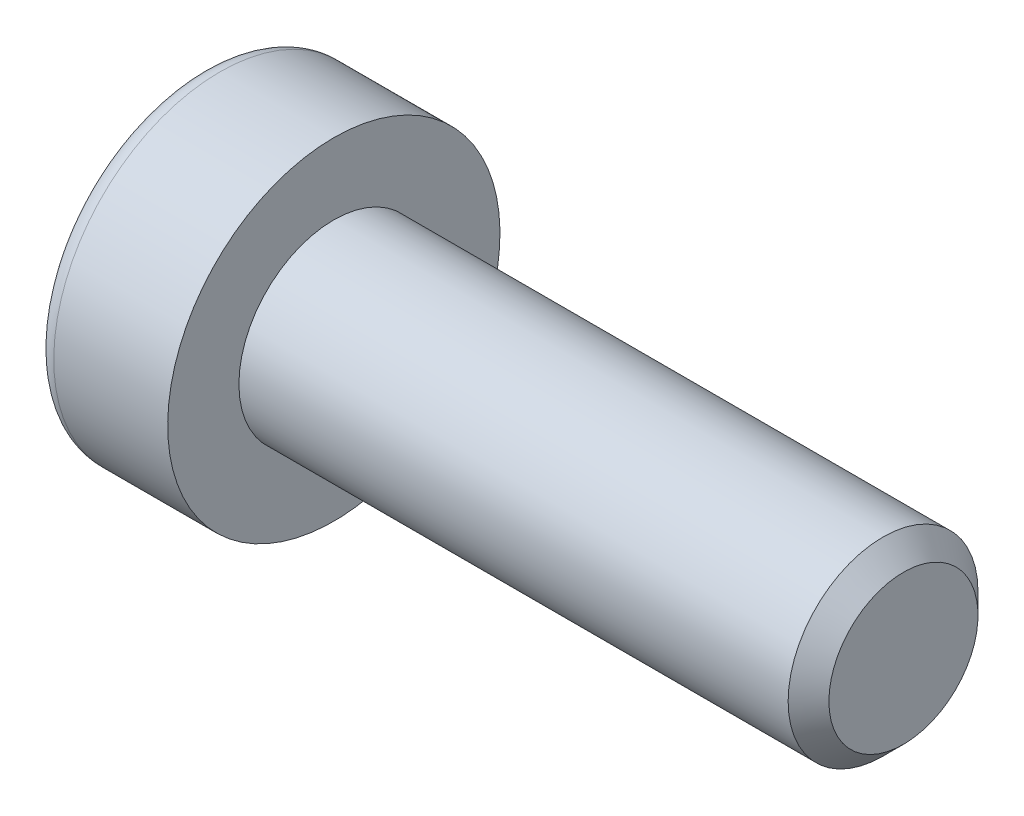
ISO-10303-21;
HEADER;
FILE_DESCRIPTION(('STEP AP214'),'2;1');
FILE_NAME('part.step','',(''),(''),'','','');
FILE_SCHEMA(('AUTOMOTIVE_DESIGN { 1 0 10303 214 1 1 1 1 }'));
ENDSEC;
DATA;
#1=APPLICATION_CONTEXT('core data for automotive mechanical design processes');
#2=APPLICATION_PROTOCOL_DEFINITION('international standard','automotive_design',2000,#1);
#3=PRODUCT_CONTEXT('',#1,'mechanical');
#4=PRODUCT('Part','Part','',(#3));
#5=PRODUCT_RELATED_PRODUCT_CATEGORY('part','',(#4));
#6=PRODUCT_DEFINITION_FORMATION('','',#4);
#7=PRODUCT_DEFINITION_CONTEXT('part definition',#1,'design');
#8=PRODUCT_DEFINITION('design','',#6,#7);
#9=PRODUCT_DEFINITION_SHAPE('','',#8);
#10=(LENGTH_UNIT() NAMED_UNIT(*) SI_UNIT(.MILLI.,.METRE.));
#11=(NAMED_UNIT(*) PLANE_ANGLE_UNIT() SI_UNIT($,.RADIAN.));
#12=(NAMED_UNIT(*) SI_UNIT($,.STERADIAN.) SOLID_ANGLE_UNIT());
#13=UNCERTAINTY_MEASURE_WITH_UNIT(LENGTH_MEASURE(1.E-05),#10,'distance_accuracy_value','');
#14=(GEOMETRIC_REPRESENTATION_CONTEXT(3) GLOBAL_UNCERTAINTY_ASSIGNED_CONTEXT((#13)) GLOBAL_UNIT_ASSIGNED_CONTEXT((#10,
#11,#12)) REPRESENTATION_CONTEXT('',''));
#15=CARTESIAN_POINT('',(0.,0.,0.));
#16=DIRECTION('',(0.,0.,1.));
#17=DIRECTION('',(1.,0.,0.));
#18=AXIS2_PLACEMENT_3D('',#15,#16,#17);
#19=CARTESIAN_POINT('',(-2.8,-1.25,0.721687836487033));
#20=DIRECTION('',(0.,-0.5,0.866025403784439));
#21=DIRECTION('',(0.,-0.866025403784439,-0.5));
#22=AXIS2_PLACEMENT_3D('',#19,#20,#21);
#23=PLANE('',#22);
#24=DIRECTION('',(1.,0.,0.));
#25=VECTOR('',#24,1.);
#26=CARTESIAN_POINT('',(-2.8,-1.25,0.721687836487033));
#27=LINE('',#26,#25);
#28=CARTESIAN_POINT('',(-0.500000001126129,-1.24999999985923,0.721687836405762));
#29=VERTEX_POINT('',#28);
#30=CARTESIAN_POINT('',(-2.8,-1.25,0.721687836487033));
#31=VERTEX_POINT('',#30);
#32=EDGE_CURVE('E76',#29,#31,#27,.F.);
#33=ORIENTED_EDGE('',*,*,#32,.T.);
#34=DIRECTION('',(0.,-0.866025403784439,-0.5));
#35=VECTOR('',#34,1.);
#36=CARTESIAN_POINT('',(-2.8,-1.25,0.721687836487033));
#37=LINE('',#36,#35);
#38=CARTESIAN_POINT('',(-2.8,0.,1.44337567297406));
#39=VERTEX_POINT('',#38);
#40=EDGE_CURVE('E82',#39,#31,#37,.T.);
#41=ORIENTED_EDGE('',*,*,#40,.F.);
#42=DIRECTION('',(1.,0.,0.));
#43=VECTOR('',#42,1.);
#44=CARTESIAN_POINT('',(-2.8,0.,1.44337567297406));
#45=LINE('',#44,#43);
#46=CARTESIAN_POINT('',(-0.500000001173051,-1.40766858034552E-10,1.44337567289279));
#47=VERTEX_POINT('',#46);
#48=EDGE_CURVE('E79',#39,#47,#45,.T.);
#49=ORIENTED_EDGE('',*,*,#48,.T.);
#50=CARTESIAN_POINT('',(-0.500000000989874,-1.24999999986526,0.721687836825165));
#51=CARTESIAN_POINT('',(-0.481684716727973,-1.19507007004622,0.753401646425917));
#52=CARTESIAN_POINT('',(-0.465027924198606,-1.13966598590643,0.78538920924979));
#53=CARTESIAN_POINT('',(-0.435953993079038,-1.02789853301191,0.849918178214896));
#54=CARTESIAN_POINT('',(-0.423547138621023,-0.971533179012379,0.882460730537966));
#55=CARTESIAN_POINT('',(-0.404234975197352,-0.859500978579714,0.947142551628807));
#56=CARTESIAN_POINT('',(-0.397201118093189,-0.803851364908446,0.979271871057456));
#57=CARTESIAN_POINT('',(-0.388805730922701,-0.692290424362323,1.04368161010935));
#58=CARTESIAN_POINT('',(-0.387437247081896,-0.636379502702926,1.07596179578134));
#59=CARTESIAN_POINT('',(-0.390291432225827,-0.531915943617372,1.1362738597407));
#60=CARTESIAN_POINT('',(-0.393813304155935,-0.483347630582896,1.16431478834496));
#61=CARTESIAN_POINT('',(-0.404973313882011,-0.386527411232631,1.22021396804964));
#62=CARTESIAN_POINT('',(-0.412615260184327,-0.338275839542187,1.24807202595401));
#63=CARTESIAN_POINT('',(-0.431718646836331,-0.241256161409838,1.30408636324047));
#64=CARTESIAN_POINT('',(-0.443261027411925,-0.192500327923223,1.33223555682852));
#65=CARTESIAN_POINT('',(-0.469457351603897,-0.0957156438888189,1.38811422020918));
#66=CARTESIAN_POINT('',(-0.484105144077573,-0.0476855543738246,1.41584440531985));
#67=CARTESIAN_POINT('',(-0.500000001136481,-2.50478505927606E-10,1.44337567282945));
#68=B_SPLINE_CURVE_WITH_KNOTS('',3,(#50,#51,#52,#53,#54,#55,#56,#57,#58,#59,#60,#61,#62,#63,#64,
#65,#66,#67),.UNSPECIFIED.,.F.,.F.,(4,2,2,2,2,2,2,2,4),(0.,0.198135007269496,0.396746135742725,
0.590442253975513,0.783900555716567,0.952317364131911,1.12089012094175,1.29320101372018,
1.46517373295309),.UNSPECIFIED.);
#69=EDGE_CURVE('E19',#29,#47,#68,.T.);
#70=ORIENTED_EDGE('',*,*,#69,.F.);
#71=EDGE_LOOP('',(#33,#41,#49,#70));
#72=FACE_BOUND('',#71,.T.);
#73=ADVANCED_FACE('F15',(#72),#23,.F.);
#74=CARTESIAN_POINT('',(-2.8,-1.25,-0.721687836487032));
#75=DIRECTION('',(0.,-1.,0.));
#76=DIRECTION('',(0.,0.,-1.));
#77=AXIS2_PLACEMENT_3D('',#74,#75,#76);
#78=PLANE('',#77);
#79=DIRECTION('',(1.,0.,0.));
#80=VECTOR('',#79,1.);
#81=CARTESIAN_POINT('',(-2.8,-1.25,-0.721687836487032));
#82=LINE('',#81,#80);
#83=CARTESIAN_POINT('',(-0.500000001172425,-1.25,-0.721687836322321));
#84=VERTEX_POINT('',#83);
#85=CARTESIAN_POINT('',(-2.8,-1.25,-0.721687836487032));
#86=VERTEX_POINT('',#85);
#87=EDGE_CURVE('E150',#84,#86,#82,.F.);
#88=ORIENTED_EDGE('',*,*,#87,.T.);
#89=DIRECTION('',(0.,0.,-1.));
#90=VECTOR('',#89,1.);
#91=CARTESIAN_POINT('',(-2.8,-1.25,-0.721687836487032));
#92=LINE('',#91,#90);
#93=EDGE_CURVE('E93',#31,#86,#92,.T.);
#94=ORIENTED_EDGE('',*,*,#93,.F.);
#95=ORIENTED_EDGE('',*,*,#32,.F.);
#96=CARTESIAN_POINT('',(-0.500000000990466,-1.25000000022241,-0.721687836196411));
#97=CARTESIAN_POINT('',(-0.481684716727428,-1.25000000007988,-0.658260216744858));
#98=CARTESIAN_POINT('',(-0.465027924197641,-1.25000000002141,-0.594285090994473));
#99=CARTESIAN_POINT('',(-0.435953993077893,-1.24999999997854,-0.465227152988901));
#100=CARTESIAN_POINT('',(-0.423547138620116,-1.24999999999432,-0.400142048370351));
#101=CARTESIAN_POINT('',(-0.404234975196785,-1.25000000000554,-0.27077840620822));
#102=CARTESIAN_POINT('',(-0.397201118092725,-1.25000000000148,-0.206519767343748));
#103=CARTESIAN_POINT('',(-0.388805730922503,-1.24999999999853,-0.0777002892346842));
#104=CARTESIAN_POINT('',(-0.387437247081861,-1.24999999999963,-0.0131399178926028));
#105=CARTESIAN_POINT('',(-0.390291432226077,-1.25000000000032,0.107484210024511));
#106=CARTESIAN_POINT('',(-0.393813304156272,-1.25000000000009,0.163566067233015));
#107=CARTESIAN_POINT('',(-0.404973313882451,-1.24999999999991,0.27536442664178));
#108=CARTESIAN_POINT('',(-0.412615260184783,-1.24999999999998,0.331080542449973));
#109=CARTESIAN_POINT('',(-0.431718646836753,-1.25000000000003,0.443109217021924));
#110=CARTESIAN_POINT('',(-0.443261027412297,-1.25000000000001,0.499407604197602));
#111=CARTESIAN_POINT('',(-0.469457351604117,-1.24999999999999,0.611164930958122));
#112=CARTESIAN_POINT('',(-0.484105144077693,-1.24999999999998,0.666625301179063));
#113=CARTESIAN_POINT('',(-0.500000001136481,-1.25,0.721687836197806));
#114=B_SPLINE_CURVE_WITH_KNOTS('',3,(#96,#97,#98,#99,#100,#101,#102,#103,#104,#105,#106,#107,
#108,#109,#110,#111,#112,#113),.UNSPECIFIED.,.F.,.F.,(4,2,2,2,2,2,2,2,4),(0.,0.198135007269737,
0.39674613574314,0.590442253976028,0.783900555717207,0.952317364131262,1.12089012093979,
1.2932010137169,1.46517373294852),.UNSPECIFIED.);
#115=EDGE_CURVE('E84',#84,#29,#114,.T.);
#116=ORIENTED_EDGE('',*,*,#115,.F.);
#117=EDGE_LOOP('',(#88,#94,#95,#116));
#118=FACE_BOUND('',#117,.T.);
#119=ADVANCED_FACE('F94',(#118),#78,.F.);
#120=CARTESIAN_POINT('',(-2.8,0.,1.44337567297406));
#121=DIRECTION('',(0.,0.500000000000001,0.866025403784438));
#122=DIRECTION('',(0.,-0.866025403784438,0.500000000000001));
#123=AXIS2_PLACEMENT_3D('',#120,#121,#122);
#124=PLANE('',#123);
#125=ORIENTED_EDGE('',*,*,#48,.F.);
#126=DIRECTION('',(0.,-0.866025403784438,0.500000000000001));
#127=VECTOR('',#126,1.);
#128=CARTESIAN_POINT('',(-2.8,0.,1.44337567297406));
#129=LINE('',#128,#127);
#130=CARTESIAN_POINT('',(-2.8,1.25,0.721687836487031));
#131=VERTEX_POINT('',#130);
#132=EDGE_CURVE('E92',#131,#39,#129,.T.);
#133=ORIENTED_EDGE('',*,*,#132,.F.);
#134=DIRECTION('',(1.,0.,0.));
#135=VECTOR('',#134,1.);
#136=CARTESIAN_POINT('',(-2.8,1.25,0.721687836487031));
#137=LINE('',#136,#135);
#138=CARTESIAN_POINT('',(-0.500000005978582,1.25000001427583,0.721687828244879));
#139=VERTEX_POINT('',#138);
#140=EDGE_CURVE('E225',#131,#139,#137,.T.);
#141=ORIENTED_EDGE('',*,*,#140,.T.);
#142=CARTESIAN_POINT('',(-0.500000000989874,3.60199319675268E-10,1.44337567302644));
#143=CARTESIAN_POINT('',(-0.481684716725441,0.0549299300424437,1.411661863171));
#144=CARTESIAN_POINT('',(-0.465027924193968,0.110334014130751,1.37967430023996));
#145=CARTESIAN_POINT('',(-0.435953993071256,0.222101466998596,1.31514533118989));
#146=CARTESIAN_POINT('',(-0.423547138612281,0.278466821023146,1.28260277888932));
#147=CARTESIAN_POINT('',(-0.404234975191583,0.390499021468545,1.2179209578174));
#148=CARTESIAN_POINT('',(-0.397201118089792,0.446148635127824,1.18579163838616));
#149=CARTESIAN_POINT('',(-0.388805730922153,0.557709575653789,1.12138189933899));
#150=CARTESIAN_POINT('',(-0.387437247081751,0.613620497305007,1.08910171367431));
#151=CARTESIAN_POINT('',(-0.390291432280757,0.718084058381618,1.02878964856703));
#152=CARTESIAN_POINT('',(-0.393813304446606,0.766652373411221,1.00074871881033));
#153=CARTESIAN_POINT('',(-0.404973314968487,0.863472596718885,0.944849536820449));
#154=CARTESIAN_POINT('',(-0.412615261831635,0.911724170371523,0.916991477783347));
#155=CARTESIAN_POINT('',(-0.431718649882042,1.0087438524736,0.860977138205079));
#156=CARTESIAN_POINT('',(-0.443261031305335,1.05749968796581,0.832827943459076));
#157=CARTESIAN_POINT('',(-0.469457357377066,1.15428437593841,0.776949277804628));
#158=CARTESIAN_POINT('',(-0.484105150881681,1.20231446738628,0.749219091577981));
#159=CARTESIAN_POINT('',(-0.50000000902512,1.25000002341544,0.721687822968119));
#160=B_SPLINE_CURVE_WITH_KNOTS('',3,(#142,#143,#144,#145,#146,#147,#148,#149,#150,#151,#152,
#153,#154,#155,#156,#157,#158,#159),.UNSPECIFIED.,.F.,.F.,(4,2,2,2,2,2,2,2,4),(0.,
0.198135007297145,0.396746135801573,0.590442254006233,0.78390055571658,0.952317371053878,
1.12089013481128,1.29320103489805,1.46517376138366),.UNSPECIFIED.);
#161=EDGE_CURVE('E145',#47,#139,#160,.T.);
#162=ORIENTED_EDGE('',*,*,#161,.F.);
#163=EDGE_LOOP('',(#125,#133,#141,#162));
#164=FACE_BOUND('',#163,.T.);
#165=ADVANCED_FACE('F151',(#164),#124,.F.);
#166=CARTESIAN_POINT('',(-2.8,0.,-1.44337567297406));
#167=DIRECTION('',(0.,-0.5,-0.866025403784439));
#168=DIRECTION('',(0.,0.866025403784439,-0.5));
#169=AXIS2_PLACEMENT_3D('',#166,#167,#168);
#170=PLANE('',#169);
#171=DIRECTION('',(1.,0.,0.));
#172=VECTOR('',#171,1.);
#173=CARTESIAN_POINT('',(-2.8,0.,-1.44337567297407));
#174=LINE('',#173,#172);
#175=CARTESIAN_POINT('',(-0.499999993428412,-5.19432852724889E-08,-1.44337565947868));
#176=VERTEX_POINT('',#175);
#177=CARTESIAN_POINT('',(-2.8,0.,-1.44337567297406));
#178=VERTEX_POINT('',#177);
#179=EDGE_CURVE('E223',#176,#178,#174,.F.);
#180=ORIENTED_EDGE('',*,*,#179,.T.);
#181=DIRECTION('',(0.,0.866025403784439,-0.5));
#182=VECTOR('',#181,1.);
#183=CARTESIAN_POINT('',(-2.8,0.,-1.44337567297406));
#184=LINE('',#183,#182);
#185=EDGE_CURVE('E38',#86,#178,#184,.T.);
#186=ORIENTED_EDGE('',*,*,#185,.F.);
#187=ORIENTED_EDGE('',*,*,#87,.F.);
#188=CARTESIAN_POINT('',(-0.500000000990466,-1.24999999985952,-0.721687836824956));
#189=CARTESIAN_POINT('',(-0.481684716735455,-1.19507007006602,-0.75340164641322));
#190=CARTESIAN_POINT('',(-0.465027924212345,-1.13966598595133,-0.785389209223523));
#191=CARTESIAN_POINT('',(-0.435953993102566,-1.02789853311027,-0.849918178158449));
#192=CARTESIAN_POINT('',(-0.423547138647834,-0.971533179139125,-0.882460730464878));
#193=CARTESIAN_POINT('',(-0.404234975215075,-0.859500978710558,-0.947142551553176));
#194=CARTESIAN_POINT('',(-0.397201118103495,-0.803851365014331,-0.979271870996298));
#195=CARTESIAN_POINT('',(-0.388805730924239,-0.692290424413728,-1.0436816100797));
#196=CARTESIAN_POINT('',(-0.387437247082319,-0.636379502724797,-1.07596179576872));
#197=CARTESIAN_POINT('',(-0.390291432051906,-0.531915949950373,-1.13627385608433));
#198=CARTESIAN_POINT('',(-0.393813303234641,-0.48334764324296,-1.16431478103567));
#199=CARTESIAN_POINT('',(-0.404973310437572,-0.386527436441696,-1.22021395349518));
#200=CARTESIAN_POINT('',(-0.412615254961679,-0.33827587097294,-1.24807200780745));
#201=CARTESIAN_POINT('',(-0.431718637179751,-0.241256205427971,-1.30408633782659));
#202=CARTESIAN_POINT('',(-0.443261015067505,-0.192500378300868,-1.33223552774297));
#203=CARTESIAN_POINT('',(-0.469457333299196,-0.0957157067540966,-1.3881141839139));
#204=CARTESIAN_POINT('',(-0.48410512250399,-0.0476856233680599,-1.41584436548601));
#205=CARTESIAN_POINT('',(-0.499999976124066,-7.52877252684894E-08,-1.44337562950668));
#206=B_SPLINE_CURVE_WITH_KNOTS('',3,(#188,#189,#190,#191,#192,#193,#194,#195,#196,#197,#198,
#199,#200,#201,#202,#203,#204,#205),.UNSPECIFIED.,.F.,.F.,(4,2,2,2,2,2,2,2,4),(0.,
0.198135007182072,0.396746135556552,0.590442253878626,0.783900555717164,0.952317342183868,
1.12089007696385,1.29320094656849,1.46517364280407),.UNSPECIFIED.);
#207=EDGE_CURVE('E88',#84,#176,#206,.T.);
#208=ORIENTED_EDGE('',*,*,#207,.T.);
#209=EDGE_LOOP('',(#180,#186,#187,#208));
#210=FACE_BOUND('',#209,.T.);
#211=ADVANCED_FACE('F154',(#210),#170,.F.);
#212=CARTESIAN_POINT('',(-2.8,1.25,0.721687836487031));
#213=DIRECTION('',(0.,1.,0.));
#214=DIRECTION('',(0.,0.,1.));
#215=AXIS2_PLACEMENT_3D('',#212,#213,#214);
#216=PLANE('',#215);
#217=ORIENTED_EDGE('',*,*,#140,.F.);
#218=DIRECTION('',(0.,0.,1.));
#219=VECTOR('',#218,1.);
#220=CARTESIAN_POINT('',(-2.8,1.25,0.721687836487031));
#221=LINE('',#220,#219);
#222=CARTESIAN_POINT('',(-2.8,1.25,-0.721687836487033));
#223=VERTEX_POINT('',#222);
#224=EDGE_CURVE('E228',#223,#131,#221,.T.);
#225=ORIENTED_EDGE('',*,*,#224,.F.);
#226=DIRECTION('',(1.,0.,0.));
#227=VECTOR('',#226,1.);
#228=CARTESIAN_POINT('',(-2.8,1.25,-0.721687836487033));
#229=LINE('',#228,#227);
#230=CARTESIAN_POINT('',(-0.500000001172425,1.25,-0.721687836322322));
#231=VERTEX_POINT('',#230);
#232=EDGE_CURVE('E117',#223,#231,#229,.T.);
#233=ORIENTED_EDGE('',*,*,#232,.T.);
#234=CARTESIAN_POINT('',(-0.500000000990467,1.25000000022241,-0.721687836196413));
#235=CARTESIAN_POINT('',(-0.481684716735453,1.25000000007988,-0.658260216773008));
#236=CARTESIAN_POINT('',(-0.465027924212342,1.25000000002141,-0.594285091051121));
#237=CARTESIAN_POINT('',(-0.435953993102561,1.24999999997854,-0.465227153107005));
#238=CARTESIAN_POINT('',(-0.423547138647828,1.24999999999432,-0.400142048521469));
#239=CARTESIAN_POINT('',(-0.404234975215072,1.25000000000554,-0.27077840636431));
#240=CARTESIAN_POINT('',(-0.397201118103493,1.25000000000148,-0.206519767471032));
#241=CARTESIAN_POINT('',(-0.388805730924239,1.24999999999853,-0.0777002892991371));
#242=CARTESIAN_POINT('',(-0.387437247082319,1.24999999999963,-0.0131399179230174));
#243=CARTESIAN_POINT('',(-0.390291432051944,1.25000000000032,0.107484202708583));
#244=CARTESIAN_POINT('',(-0.393813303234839,1.25000000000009,0.163566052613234));
#245=CARTESIAN_POINT('',(-0.404973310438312,1.24999999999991,0.275364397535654));
#246=CARTESIAN_POINT('',(-0.412615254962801,1.24999999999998,0.331080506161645));
#247=CARTESIAN_POINT('',(-0.431718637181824,1.25000000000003,0.443109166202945));
#248=CARTESIAN_POINT('',(-0.443261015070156,1.25000000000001,0.499407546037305));
#249=CARTESIAN_POINT('',(-0.469457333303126,1.24999999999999,0.6111648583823));
#250=CARTESIAN_POINT('',(-0.484105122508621,1.24999999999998,0.666625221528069));
#251=CARTESIAN_POINT('',(-0.499999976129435,1.25,0.721687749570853));
#252=B_SPLINE_CURVE_WITH_KNOTS('',3,(#234,#235,#236,#237,#238,#239,#240,#241,#242,#243,#244,
#245,#246,#247,#248,#249,#250,#251),.UNSPECIFIED.,.F.,.F.,(4,2,2,2,2,2,2,2,4),(0.,
0.198135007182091,0.396746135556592,0.590442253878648,0.783900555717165,0.95231734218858,
1.12089007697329,1.2932009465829,1.46517364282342),.UNSPECIFIED.);
#253=EDGE_CURVE('E118',#231,#139,#252,.T.);
#254=ORIENTED_EDGE('',*,*,#253,.T.);
#255=EDGE_LOOP('',(#217,#225,#233,#254));
#256=FACE_BOUND('',#255,.T.);
#257=ADVANCED_FACE('F129',(#256),#216,.F.);
#258=CARTESIAN_POINT('',(-0.505000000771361,0.,0.));
#259=DIRECTION('',(-1.,0.,0.));
#260=DIRECTION('',(0.,0.,1.));
#261=AXIS2_PLACEMENT_3D('',#258,#259,#260);
#262=CONICAL_SURFACE('',#261,1.45203592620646,1.04719754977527);
#263=CARTESIAN_POINT('',(0.333333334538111,-1.70530256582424E-10,0.));
#264=VERTEX_POINT('',#263);
#265=VERTEX_LOOP('',#264);
#266=FACE_BOUND('',#265,.T.);
#267=ORIENTED_EDGE('',*,*,#253,.F.);
#268=CARTESIAN_POINT('',(-0.500000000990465,1.24999999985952,-0.721687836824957));
#269=CARTESIAN_POINT('',(-0.481684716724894,1.19507007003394,-0.753401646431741));
#270=CARTESIAN_POINT('',(-0.465027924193,1.13966598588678,-0.785389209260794));
#271=CARTESIAN_POINT('',(-0.435953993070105,1.02789853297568,-0.849918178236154));
#272=CARTESIAN_POINT('',(-0.423547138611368,0.971533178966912,-0.882460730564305));
#273=CARTESIAN_POINT('',(-0.404234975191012,0.859500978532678,-0.947142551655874));
#274=CARTESIAN_POINT('',(-0.397201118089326,0.803851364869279,-0.979271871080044));
#275=CARTESIAN_POINT('',(-0.388805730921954,0.692290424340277,-1.0436816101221));
#276=CARTESIAN_POINT('',(-0.387437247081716,0.636379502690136,-1.07596179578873));
#277=CARTESIAN_POINT('',(-0.390291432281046,0.531915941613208,-1.1362738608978));
#278=CARTESIAN_POINT('',(-0.393813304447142,0.483347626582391,-1.16431479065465));
#279=CARTESIAN_POINT('',(-0.404973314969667,0.386527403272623,-1.22021397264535));
#280=CARTESIAN_POINT('',(-0.412615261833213,0.338275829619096,-1.24807203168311));
#281=CARTESIAN_POINT('',(-0.431718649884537,0.241256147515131,-1.30408637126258));
#282=CARTESIAN_POINT('',(-0.443261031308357,0.19250031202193,-1.33223556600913));
#283=CARTESIAN_POINT('',(-0.469457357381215,0.0957156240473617,-1.38811423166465));
#284=CARTESIAN_POINT('',(-0.484105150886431,0.0476855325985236,-1.41584441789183));
#285=CARTESIAN_POINT('',(-0.50000000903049,-2.34315494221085E-08,-1.44337568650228));
#286=B_SPLINE_CURVE_WITH_KNOTS('',3,(#268,#269,#270,#271,#272,#273,#274,#275,#276,#277,#278,
#279,#280,#281,#282,#283,#284,#285),.UNSPECIFIED.,.F.,.F.,(4,2,2,2,2,2,2,2,4),(0.,
0.198135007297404,0.396746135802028,0.590442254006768,0.78390055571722,0.952317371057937,
1.12089013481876,1.29320103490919,1.46517376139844),.UNSPECIFIED.);
#287=EDGE_CURVE('E110',#231,#176,#286,.T.);
#288=ORIENTED_EDGE('',*,*,#287,.T.);
#289=ORIENTED_EDGE('',*,*,#207,.F.);
#290=ORIENTED_EDGE('',*,*,#115,.T.);
#291=ORIENTED_EDGE('',*,*,#69,.T.);
#292=ORIENTED_EDGE('',*,*,#161,.T.);
#293=EDGE_LOOP('',(#267,#288,#289,#290,#291,#292));
#294=FACE_BOUND('',#293,.T.);
#295=ADVANCED_FACE('F86',(#266,#294),#262,.F.);
#296=CARTESIAN_POINT('',(-2.8,1.25,-0.721687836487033));
#297=DIRECTION('',(0.,0.5,-0.866025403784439));
#298=DIRECTION('',(0.,0.866025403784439,0.5));
#299=AXIS2_PLACEMENT_3D('',#296,#297,#298);
#300=PLANE('',#299);
#301=ORIENTED_EDGE('',*,*,#232,.F.);
#302=DIRECTION('',(0.,0.866025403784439,0.5));
#303=VECTOR('',#302,1.);
#304=CARTESIAN_POINT('',(-2.8,0.,-1.44337567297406));
#305=LINE('',#304,#303);
#306=EDGE_CURVE('E116',#178,#223,#305,.T.);
#307=ORIENTED_EDGE('',*,*,#306,.F.);
#308=ORIENTED_EDGE('',*,*,#179,.F.);
#309=ORIENTED_EDGE('',*,*,#287,.F.);
#310=EDGE_LOOP('',(#301,#307,#308,#309));
#311=FACE_BOUND('',#310,.T.);
#312=ADVANCED_FACE('F124',(#311),#300,.F.);
#313=CARTESIAN_POINT('',(-2.8,2.47168783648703,0.));
#314=DIRECTION('',(-1.,0.,0.));
#315=DIRECTION('',(0.,0.,1.));
#316=AXIS2_PLACEMENT_3D('',#313,#314,#315);
#317=PLANE('',#316);
#318=ORIENTED_EDGE('',*,*,#185,.T.);
#319=ORIENTED_EDGE('',*,*,#306,.T.);
#320=ORIENTED_EDGE('',*,*,#224,.T.);
#321=ORIENTED_EDGE('',*,*,#132,.T.);
#322=ORIENTED_EDGE('',*,*,#40,.T.);
#323=ORIENTED_EDGE('',*,*,#93,.T.);
#324=EDGE_LOOP('',(#318,#319,#320,#321,#322,#323));
#325=FACE_BOUND('',#324,.T.);
#326=CARTESIAN_POINT('',(-2.8,0.,0.));
#327=DIRECTION('',(1.,0.,0.));
#328=DIRECTION('',(0.,1.,0.));
#329=AXIS2_PLACEMENT_3D('',#326,#327,#328);
#330=CIRCLE('',#329,3.1);
#331=CARTESIAN_POINT('',(-2.8,3.1,0.));
#332=VERTEX_POINT('',#331);
#333=EDGE_CURVE('E204',#332,#332,#330,.T.);
#334=ORIENTED_EDGE('',*,*,#333,.F.);
#335=EDGE_LOOP('',(#334));
#336=FACE_BOUND('',#335,.T.);
#337=ADVANCED_FACE('F191',(#325,#336),#317,.T.);
#338=CARTESIAN_POINT('',(-2.4,0.,0.));
#339=DIRECTION('',(1.,0.,0.));
#340=DIRECTION('',(0.,0.,-1.));
#341=AXIS2_PLACEMENT_3D('',#338,#339,#340);
#342=TOROIDAL_SURFACE('',#341,3.1,0.4);
#343=CARTESIAN_POINT('',(-2.4,0.,0.));
#344=DIRECTION('',(1.,0.,0.));
#345=DIRECTION('',(0.,1.,0.));
#346=AXIS2_PLACEMENT_3D('',#343,#344,#345);
#347=CIRCLE('',#346,3.5);
#348=CARTESIAN_POINT('',(-2.4,3.5,0.));
#349=VERTEX_POINT('',#348);
#350=EDGE_CURVE('E109',#349,#349,#347,.T.);
#351=ORIENTED_EDGE('',*,*,#350,.F.);
#352=EDGE_LOOP('',(#351));
#353=FACE_BOUND('',#352,.T.);
#354=ORIENTED_EDGE('',*,*,#333,.T.);
#355=EDGE_LOOP('',(#354));
#356=FACE_BOUND('',#355,.T.);
#357=ADVANCED_FACE('F186',(#353,#356),#342,.T.);
#358=CARTESIAN_POINT('',(-1.4,0.,0.));
#359=DIRECTION('',(1.,0.,0.));
#360=DIRECTION('',(0.,1.,0.));
#361=AXIS2_PLACEMENT_3D('',#358,#359,#360);
#362=CYLINDRICAL_SURFACE('',#361,3.5);
#363=ORIENTED_EDGE('',*,*,#350,.T.);
#364=EDGE_LOOP('',(#363));
#365=FACE_BOUND('',#364,.T.);
#366=CARTESIAN_POINT('',(0.,0.,0.));
#367=DIRECTION('',(1.,0.,0.));
#368=DIRECTION('',(0.,1.,0.));
#369=AXIS2_PLACEMENT_3D('',#366,#367,#368);
#370=CIRCLE('',#369,3.5);
#371=CARTESIAN_POINT('',(0.,3.5,0.));
#372=VERTEX_POINT('',#371);
#373=EDGE_CURVE('E106',#372,#372,#370,.T.);
#374=ORIENTED_EDGE('',*,*,#373,.F.);
#375=EDGE_LOOP('',(#374));
#376=FACE_BOUND('',#375,.T.);
#377=ADVANCED_FACE('F182',(#365,#376),#362,.T.);
#378=CARTESIAN_POINT('',(12.,1.,0.));
#379=DIRECTION('',(1.,0.,0.));
#380=DIRECTION('',(0.,0.,-1.));
#381=AXIS2_PLACEMENT_3D('',#378,#379,#380);
#382=PLANE('',#381);
#383=CARTESIAN_POINT('',(12.0000000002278,0.,0.));
#384=DIRECTION('',(-1.,0.,0.));
#385=DIRECTION('',(0.,0.,1.));
#386=AXIS2_PLACEMENT_3D('',#383,#384,#385);
#387=CIRCLE('',#386,1.57058500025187);
#388=CARTESIAN_POINT('',(12.0000000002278,0.,1.57058500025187));
#389=VERTEX_POINT('',#388);
#390=EDGE_CURVE('E103',#389,#389,#387,.T.);
#391=ORIENTED_EDGE('',*,*,#390,.F.);
#392=EDGE_LOOP('',(#391));
#393=FACE_BOUND('',#392,.T.);
#394=ADVANCED_FACE('F178',(#393),#382,.T.);
#395=CARTESIAN_POINT('',(0.,2.75,0.));
#396=DIRECTION('',(1.,0.,0.));
#397=DIRECTION('',(0.,0.,-1.));
#398=AXIS2_PLACEMENT_3D('',#395,#396,#397);
#399=PLANE('',#398);
#400=CARTESIAN_POINT('',(0.,0.,0.));
#401=DIRECTION('',(1.,0.,0.));
#402=DIRECTION('',(0.,1.,0.));
#403=AXIS2_PLACEMENT_3D('',#400,#401,#402);
#404=CIRCLE('',#403,2.);
#405=CARTESIAN_POINT('',(0.,2.,0.));
#406=VERTEX_POINT('',#405);
#407=EDGE_CURVE('E29',#406,#406,#404,.T.);
#408=ORIENTED_EDGE('',*,*,#407,.F.);
#409=EDGE_LOOP('',(#408));
#410=FACE_BOUND('',#409,.T.);
#411=ORIENTED_EDGE('',*,*,#373,.T.);
#412=EDGE_LOOP('',(#411));
#413=FACE_BOUND('',#412,.T.);
#414=ADVANCED_FACE('F171',(#410,#413),#399,.T.);
#415=CARTESIAN_POINT('',(11.570584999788,0.,0.));
#416=DIRECTION('',(-1.,0.,0.));
#417=DIRECTION('',(0.,0.,1.));
#418=AXIS2_PLACEMENT_3D('',#415,#416,#417);
#419=CONICAL_SURFACE('',#418,1.99999999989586,0.78539816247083);
#420=ORIENTED_EDGE('',*,*,#390,.T.);
#421=EDGE_LOOP('',(#420));
#422=FACE_BOUND('',#421,.T.);
#423=CARTESIAN_POINT('',(11.570585,0.,0.));
#424=DIRECTION('',(1.,0.,0.));
#425=DIRECTION('',(0.,1.,0.));
#426=AXIS2_PLACEMENT_3D('',#423,#424,#425);
#427=CIRCLE('',#426,2.);
#428=CARTESIAN_POINT('',(11.570585,2.,0.));
#429=VERTEX_POINT('',#428);
#430=EDGE_CURVE('E10',#429,#429,#427,.F.);
#431=ORIENTED_EDGE('',*,*,#430,.F.);
#432=EDGE_LOOP('',(#431));
#433=FACE_BOUND('',#432,.T.);
#434=ADVANCED_FACE('F165',(#422,#433),#419,.T.);
#435=CARTESIAN_POINT('',(7.05,0.,0.));
#436=DIRECTION('',(1.,0.,0.));
#437=DIRECTION('',(0.,1.,0.));
#438=AXIS2_PLACEMENT_3D('',#435,#436,#437);
#439=CYLINDRICAL_SURFACE('',#438,2.);
#440=ORIENTED_EDGE('',*,*,#430,.T.);
#441=EDGE_LOOP('',(#440));
#442=FACE_BOUND('',#441,.T.);
#443=ORIENTED_EDGE('',*,*,#407,.T.);
#444=EDGE_LOOP('',(#443));
#445=FACE_BOUND('',#444,.T.);
#446=ADVANCED_FACE('F163',(#442,#445),#439,.T.);
#447=CLOSED_SHELL('',(#73,#119,#165,#211,#257,#295,#312,#337,#357,#377,#394,#414,#434,#446));
#448=MANIFOLD_SOLID_BREP('B1',#447);
#449=ADVANCED_BREP_SHAPE_REPRESENTATION('',(#18,#448),#14);
#450=SHAPE_DEFINITION_REPRESENTATION(#9,#449);
ENDSEC;
END-ISO-10303-21;
